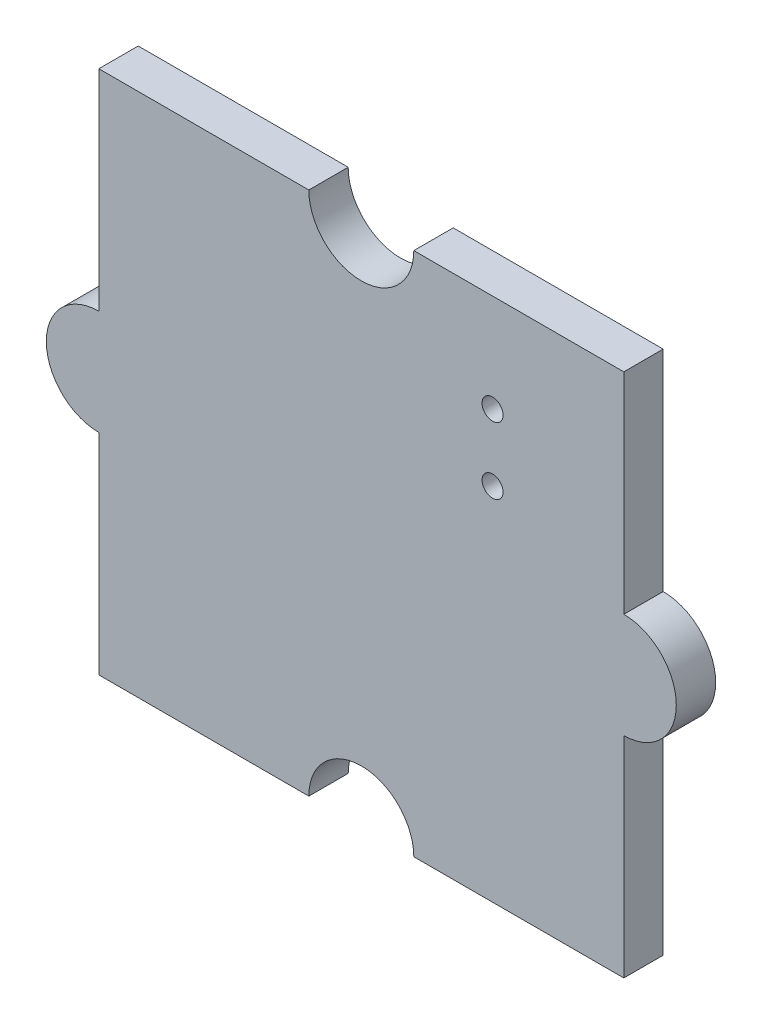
from build123d import *

# Parameters (mm, degrees)
BOSS_EXTRU_1_DEPTH      = 1.5
ESQUISSE2_R             = 0.4
ESQUISSE2_R_2           = 2
ENL_V_MAT_EXTRU_1_DEPTH = 10


with BuildPart() as part:
    # Esquisse1 → Boss.-Extru.1 (new body)
    with BuildSketch(Plane.XY):
        with BuildLine():
            Line((0, 12), (0, 20))
            Line((0, 20), (20, 20))
            Line((20, 20), (20, 12))
            ThreePointArc((20, 12), (22, 10), (20, 8))
            Line((20, 8), (20, 0))
            Line((20, 0), (0, 0))
            Line((0, 0), (0, 8))
            ThreePointArc((0, 8), (-2, 10), (0, 12))
        make_face()
    extrude(amount=BOSS_EXTRU_1_DEPTH)

    # Esquisse2 → Enl_v. mat.-Extru.1 (cut)
    with BuildSketch(Plane.XY.offset(1.5)):
        with Locations((15, 13.73)):
            Circle(ESQUISSE2_R)
        with Locations((15, 16.27)):
            Circle(ESQUISSE2_R)
        with Locations((10, 20)):
            Circle(ESQUISSE2_R_2)
        with Locations((10, 0)):
            Circle(ESQUISSE2_R_2)
    extrude(amount=-ENL_V_MAT_EXTRU_1_DEPTH, mode=Mode.SUBTRACT)


solid = part.part
